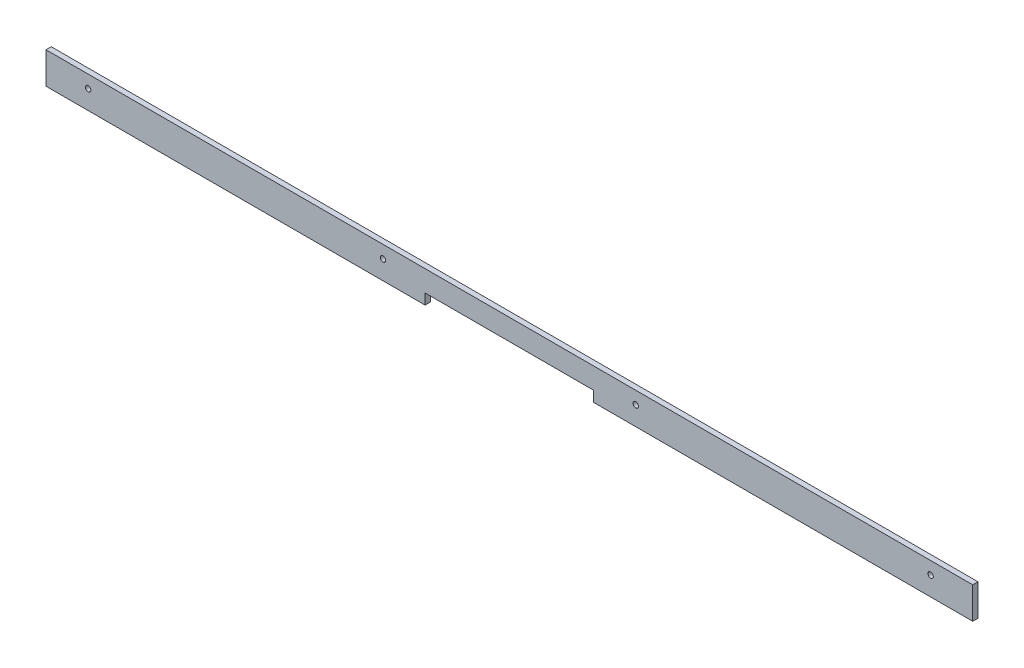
from build123d import *

# Parameters (mm, degrees)
SKETCH1_W             = 558.8
SKETCH1_H             = 19.05
BOSS_EXTRUDE1_DEPTH   = 3.175
SKETCH2_W             = 101.6
SKETCH2_H             = 6.35
CUT_EXTRUDE1_DEPTH    = 280.580339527
F_4_CLEARANCE_HOLE1_D = 3.2639


with BuildPart() as part:
    # Sketch1 → Boss-Extrude1 (new body)
    with BuildSketch(Plane.XY):
        Rectangle(SKETCH1_W, SKETCH1_H)
    extrude(amount=BOSS_EXTRUDE1_DEPTH)

    # Sketch2 → Cut-Extrude1 (cut, through all)
    with BuildSketch(Plane.XY.offset(3.175)):
        with Locations((0, -6.35)):
            Rectangle(SKETCH2_W, SKETCH2_H)
    extrude(amount=-CUT_EXTRUDE1_DEPTH, mode=Mode.SUBTRACT)

    # 4 Clearance Hole1 (through all)
    with Locations(Plane.XY.offset(3.175)):
        with Locations((-254, 1.905), (-76.2, 1.905), (76.2, 1.905), (254, 1.905)):
            Hole(F_4_CLEARANCE_HOLE1_D / 2)


solid = part.part
